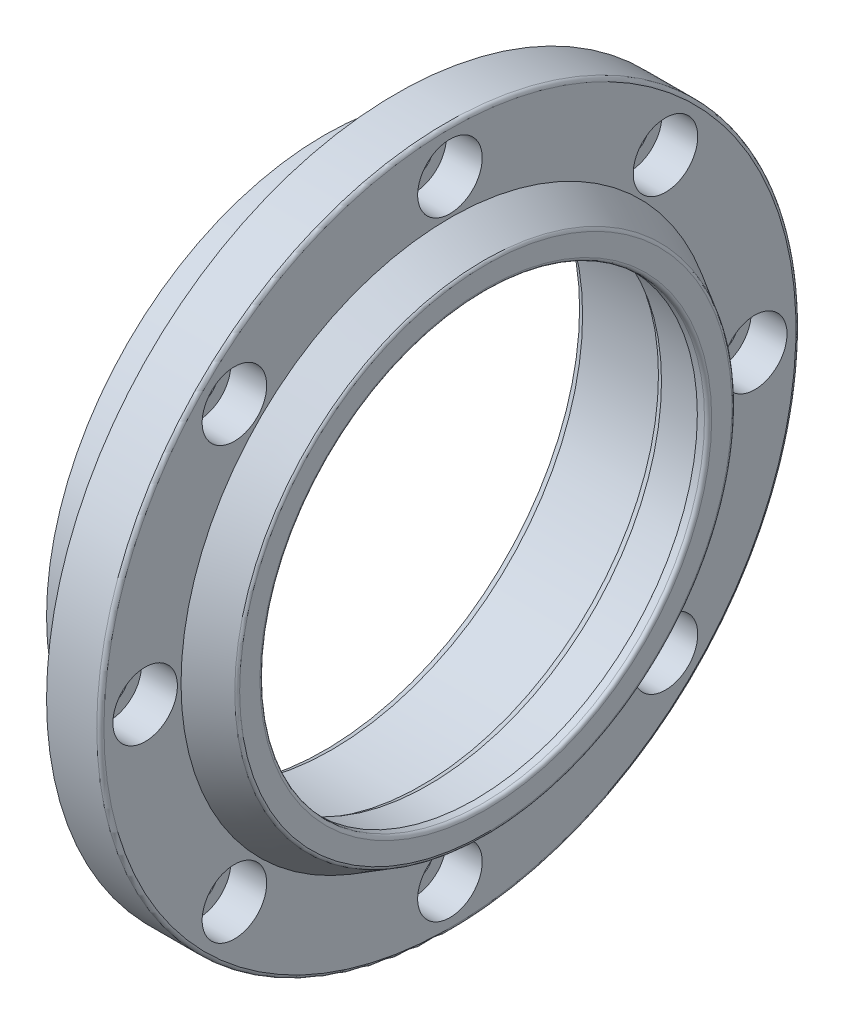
from build123d import *

# Parameters (mm, degrees)
CHANFREIN1_SIZE                                    = 2
CHANFREIN1_SIZE2                                   = 1.154700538
CHANFREIN2_SIZE                                    = 2
CHANFREIN2_SIZE2                                   = 1.154700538
CONG_1_R                                           = 1
CHAMBRAGE_POUR_VIS_T_TE_RONDE_BOMB_E_M_D           = 11
CHAMBRAGE_POUR_VIS_T_TE_RONDE_BOMB_E_M_CBORE_D     = 18
CHAMBRAGE_POUR_VIS_T_TE_RONDE_BOMB_E_M_CBORE_DEPTH = 10
R_P_TITION_CIRCULAIRE1_COUNT                       = 8


with BuildPart() as part:
    # Esquisse1 → R_volution1 (revolve)
    with BuildSketch(Plane.XY, mode=Mode.PRIVATE) as r_volution1_sk:
        Polygon((0, 70), (27, 70), (27, 65), (42, 65), (42, 62), (45, 62), (45, 69.226497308), (35, 75), (35, 97.5), (20, 97.5), (20, 77.5), (11.8, 77.5), (11.8, 74.4), (7, 74.4), (7, 77.5), (0, 77.5), align=None)
    revolve(r_volution1_sk.sketch.rotate(Axis((0, 0, 0), (1, 0, 0)), 90), axis=Axis((0, 0, 0), (1, 0, 0)))

    # Chanfrein1
    chanfrein1_edges = [part.edges().sort_by_distance(p)[0] for p in [
        (27, 0, -65),
    ]]
    chanfrein1_side = [part.faces().sort_by_distance(p)[0] for p in [
        (34.5, 0, -65),
    ]]
    chamfer(chanfrein1_edges, length=CHANFREIN1_SIZE, length2=CHANFREIN1_SIZE2, reference=chanfrein1_side[0])

    # Chanfrein2
    chanfrein2_edges = [part.edges().sort_by_distance(p)[0] for p in [
        (0, 0, -70),
    ]]
    chanfrein2_side = [part.faces().sort_by_distance(p)[0] for p in [
        (13.5, 0, -70),
    ]]
    chamfer(chanfrein2_edges, length=CHANFREIN2_SIZE, length2=CHANFREIN2_SIZE2, reference=chanfrein2_side[0])

    # Cong_1
    cong_1_edges = [part.edges().sort_by_distance(p)[0] for p in [
        (35, 0, -97.5),
        (45, 0, -69.226497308),
        (45, 0, -62),
    ]]
    fillet(cong_1_edges, radius=CONG_1_R)

    # Chambrage pour vis _ t_te ronde bomb_e M (through all)
    with Locations(Plane(origin=(35, 0, 0), x_dir=(0, 0, -1), z_dir=(1, 0, 0))):
        with Locations((0, 85)):
            chambrage_pour_vis_t_te_ronde_bomb_e_m = CounterBoreHole(CHAMBRAGE_POUR_VIS_T_TE_RONDE_BOMB_E_M_D / 2, CHAMBRAGE_POUR_VIS_T_TE_RONDE_BOMB_E_M_CBORE_D / 2, CHAMBRAGE_POUR_VIS_T_TE_RONDE_BOMB_E_M_CBORE_DEPTH)

    # R_p_tition circulaire1: Chambrage pour vis _ t_te ronde bomb_e M ×8 about axis
    r_p_tition_circulaire1_axis = Axis((0, 0, 0), (1, 0, 0))
    for i in range(1, R_P_TITION_CIRCULAIRE1_COUNT):
        add(chambrage_pour_vis_t_te_ronde_bomb_e_m.rotate(r_p_tition_circulaire1_axis, i * 360 / R_P_TITION_CIRCULAIRE1_COUNT), mode=Mode.SUBTRACT)


solid = part.part
